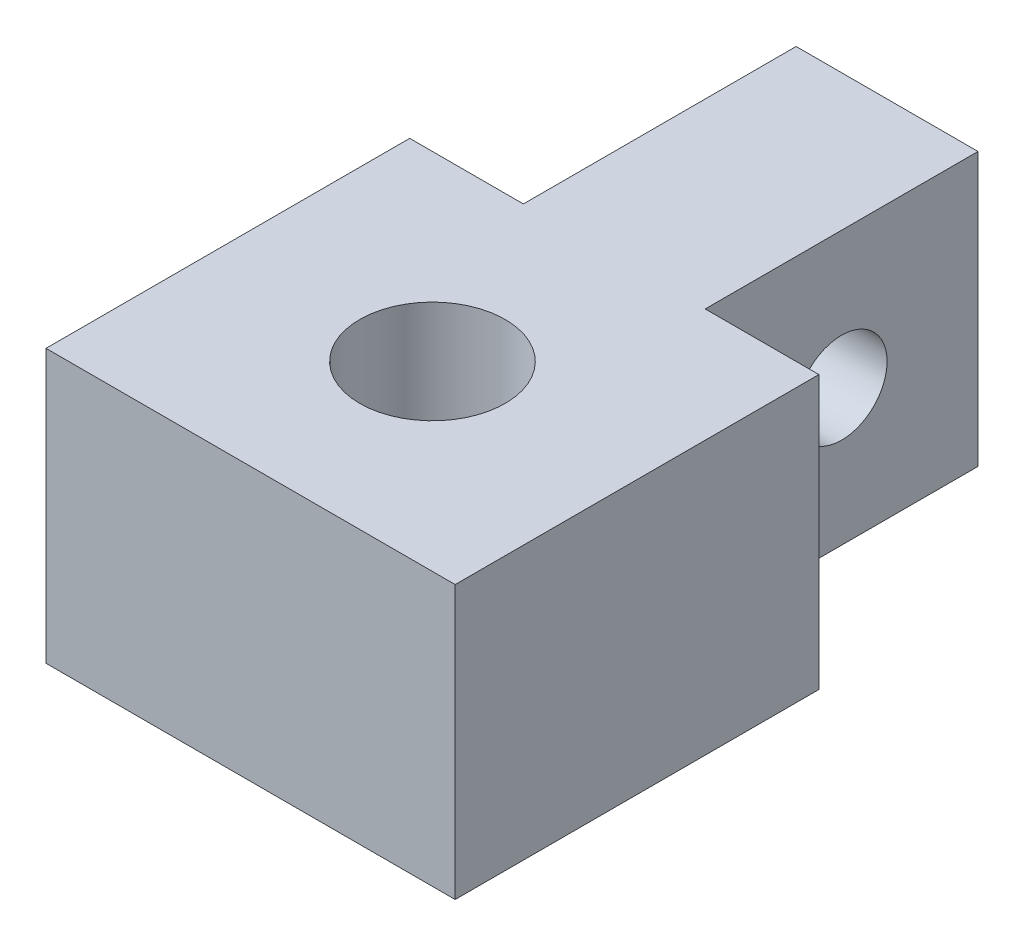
from build123d import *

# Parameters (mm, degrees)
BOSS_EXTRUDE1_DEPTH   = 3
F_1_0MM_DOWEL_HOLE1_D = 1
M2X0_4_TAPPED_HOLE1_D = 1.6


with BuildPart() as part:
    # Sketch1 → Boss-Extrude1 (new body)
    with BuildSketch(Plane(origin=(0, 0, 0), x_dir=(1, 0, 0), z_dir=(0, 1, 0))):
        Polygon((0, 0), (4.5, 0), (4.5, 4), (3.25, 4), (3.25, 7), (1.25, 7), (1.25, 4), (0, 4), align=None)
    extrude(amount=BOSS_EXTRUDE1_DEPTH)

    # 1.0mm Dowel Hole1 (through all)
    with Locations(Plane(origin=(3.25, 0, 0), x_dir=(0, 0, -1), z_dir=(1, 0, 0))):
        with Locations((5.5, 1.5)):
            Hole(F_1_0MM_DOWEL_HOLE1_D / 2)

    # M2x0.4 Tapped Hole1 (through all)
    with Locations(Plane(origin=(0, 3, 0), x_dir=(1, 0, 0), z_dir=(0, 1, 0))):
        with Locations((2.25, 2)):
            Hole(M2X0_4_TAPPED_HOLE1_D / 2)


solid = part.part
